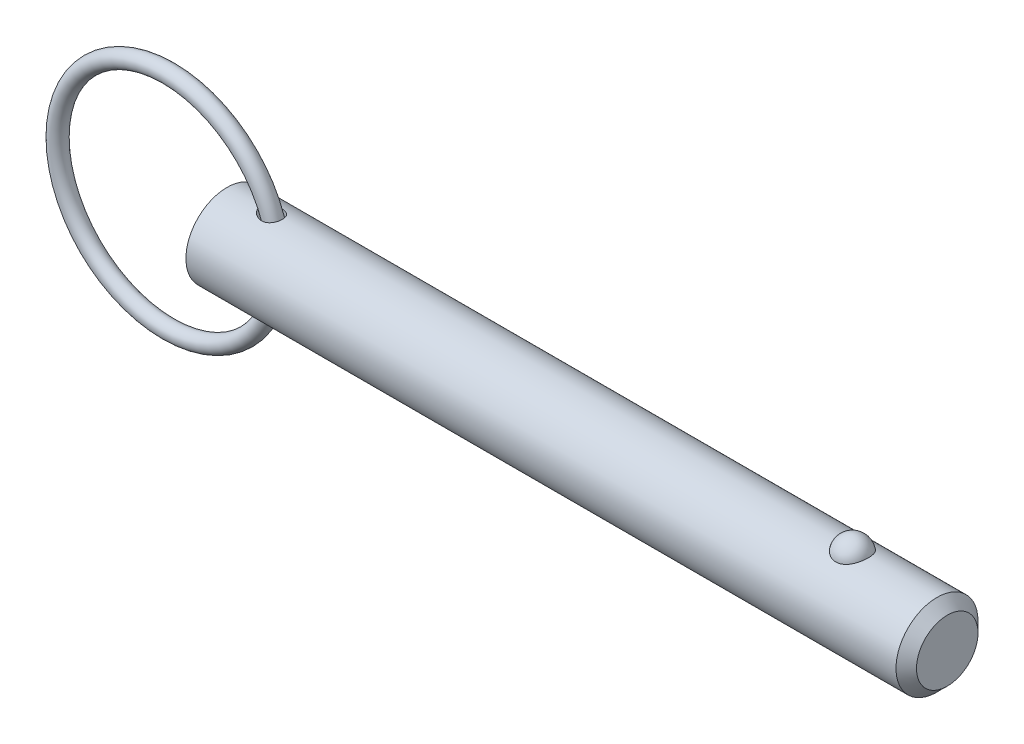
ISO-10303-21;
HEADER;
FILE_DESCRIPTION(('STEP AP214'),'2;1');
FILE_NAME('part.step','',(''),(''),'','','');
FILE_SCHEMA(('AUTOMOTIVE_DESIGN { 1 0 10303 214 1 1 1 1 }'));
ENDSEC;
DATA;
#1=APPLICATION_CONTEXT('core data for automotive mechanical design processes');
#2=APPLICATION_PROTOCOL_DEFINITION('international standard','automotive_design',2000,#1);
#3=PRODUCT_CONTEXT('',#1,'mechanical');
#4=PRODUCT('Part','Part','',(#3));
#5=PRODUCT_RELATED_PRODUCT_CATEGORY('part','',(#4));
#6=PRODUCT_DEFINITION_FORMATION('','',#4);
#7=PRODUCT_DEFINITION_CONTEXT('part definition',#1,'design');
#8=PRODUCT_DEFINITION('design','',#6,#7);
#9=PRODUCT_DEFINITION_SHAPE('','',#8);
#10=(LENGTH_UNIT() NAMED_UNIT(*) SI_UNIT(.MILLI.,.METRE.));
#11=(NAMED_UNIT(*) PLANE_ANGLE_UNIT() SI_UNIT($,.RADIAN.));
#12=(NAMED_UNIT(*) SI_UNIT($,.STERADIAN.) SOLID_ANGLE_UNIT());
#13=UNCERTAINTY_MEASURE_WITH_UNIT(LENGTH_MEASURE(1.E-05),#10,'distance_accuracy_value','');
#14=(GEOMETRIC_REPRESENTATION_CONTEXT(3) GLOBAL_UNCERTAINTY_ASSIGNED_CONTEXT((#13)) GLOBAL_UNIT_ASSIGNED_CONTEXT((#10,
#11,#12)) REPRESENTATION_CONTEXT('',''));
#15=CARTESIAN_POINT('',(0.,0.,0.));
#16=DIRECTION('',(0.,0.,1.));
#17=DIRECTION('',(1.,0.,0.));
#18=AXIS2_PLACEMENT_3D('',#15,#16,#17);
#19=CARTESIAN_POINT('',(-6.70471658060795,0.,0.));
#20=DIRECTION('',(0.,0.,1.));
#21=DIRECTION('',(1.,0.,0.));
#22=AXIS2_PLACEMENT_3D('',#19,#20,#21);
#23=TOROIDAL_SURFACE('',#22,12.7,0.940000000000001);
#24=CARTESIAN_POINT('',(6.93528341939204,0.,0.));
#25=VERTEX_POINT('',#24);
#26=VERTEX_LOOP('',#25);
#27=FACE_BOUND('',#26,.T.);
#28=ADVANCED_FACE('P0_F12',(#27),#23,.T.);
#29=CLOSED_SHELL('',(#28));
#30=MANIFOLD_SOLID_BREP('P0_B1',#29);
#31=CARTESIAN_POINT('',(0.,0.,0.));
#32=DIRECTION('',(1.,0.,0.));
#33=DIRECTION('',(0.,0.,-1.));
#34=AXIS2_PLACEMENT_3D('',#31,#32,#33);
#35=CYLINDRICAL_SURFACE('',#34,4.7);
#36=CARTESIAN_POINT('',(4.16378072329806,4.63584137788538,-0.773934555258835));
#37=CARTESIAN_POINT('',(4.22041228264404,4.62659903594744,-0.829297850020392));
#38=CARTESIAN_POINT('',(4.28206987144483,4.61719767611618,-0.879522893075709));
#39=CARTESIAN_POINT('',(4.41303152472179,4.59925351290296,-0.968997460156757));
#40=CARTESIAN_POINT('',(4.4823442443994,4.59071170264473,-1.00823437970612));
#41=CARTESIAN_POINT('',(4.626507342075,4.5755493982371,-1.07495006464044));
#42=CARTESIAN_POINT('',(4.70135029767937,4.56892638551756,-1.10244426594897));
#43=CARTESIAN_POINT('',(4.85470490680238,4.55848940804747,-1.14483874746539));
#44=CARTESIAN_POINT('',(4.93321503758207,4.55467428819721,-1.15974420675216));
#45=CARTESIAN_POINT('',(5.09197970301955,4.55051176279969,-1.17597559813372));
#46=CARTESIAN_POINT('',(5.17223836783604,4.55017372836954,-1.17726483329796));
#47=CARTESIAN_POINT('',(5.33159446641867,4.55326696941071,-1.16524823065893));
#48=CARTESIAN_POINT('',(5.41069268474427,4.55669556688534,-1.15195276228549));
#49=CARTESIAN_POINT('',(5.55698758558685,4.56647801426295,-1.11249214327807));
#50=CARTESIAN_POINT('',(5.62458628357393,4.57250771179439,-1.08773548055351));
#51=CARTESIAN_POINT('',(5.75397700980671,4.58665356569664,-1.02644632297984));
#52=CARTESIAN_POINT('',(5.81577171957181,4.59476875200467,-0.989919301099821));
#53=CARTESIAN_POINT('',(5.9268148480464,4.61135052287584,-0.909391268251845));
#54=CARTESIAN_POINT('',(5.9766679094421,4.61973919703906,-0.866204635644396));
#55=CARTESIAN_POINT('',(6.06817854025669,4.63643253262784,-0.771868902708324));
#56=CARTESIAN_POINT('',(6.10983710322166,4.64473720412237,-0.720720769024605));
#57=CARTESIAN_POINT('',(6.18318089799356,4.660174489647,-0.612928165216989));
#58=CARTESIAN_POINT('',(6.21503150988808,4.66732544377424,-0.556398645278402));
#59=CARTESIAN_POINT('',(6.26900210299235,4.67985590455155,-0.438689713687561));
#60=CARTESIAN_POINT('',(6.29112194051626,4.68523538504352,-0.377510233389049));
#61=CARTESIAN_POINT('',(6.32523846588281,4.6936733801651,-0.251831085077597));
#62=CARTESIAN_POINT('',(6.33717189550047,4.69671737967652,-0.187313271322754));
#63=CARTESIAN_POINT('',(6.35042407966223,4.70010386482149,-0.0571258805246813));
#64=CARTESIAN_POINT('',(6.3517424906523,4.70044626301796,0.00854373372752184));
#65=CARTESIAN_POINT('',(6.34371729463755,4.69838816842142,0.139481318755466));
#66=CARTESIAN_POINT('',(6.33432596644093,4.69597539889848,0.204746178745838));
#67=CARTESIAN_POINT('',(6.30500866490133,4.68864655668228,0.332720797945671));
#68=CARTESIAN_POINT('',(6.28508259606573,4.68373046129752,0.39543053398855));
#69=CARTESIAN_POINT('',(6.23516511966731,4.67193431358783,0.516455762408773));
#70=CARTESIAN_POINT('',(6.20518126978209,4.66505573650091,0.574774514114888));
#71=CARTESIAN_POINT('',(6.1358631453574,4.65009270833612,0.685387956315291));
#72=CARTESIAN_POINT('',(6.09652950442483,4.64200833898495,0.737683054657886));
#73=CARTESIAN_POINT('',(6.00979078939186,4.62559001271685,0.834455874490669));
#74=CARTESIAN_POINT('',(5.96243625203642,4.61725787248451,0.878979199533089));
#75=CARTESIAN_POINT('',(5.86079843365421,4.60122574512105,0.959378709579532));
#76=CARTESIAN_POINT('',(5.80651591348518,4.59352568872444,0.995255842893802));
#77=CARTESIAN_POINT('',(5.69277386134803,4.57961669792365,1.05741527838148));
#78=CARTESIAN_POINT('',(5.63333134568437,4.57340309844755,1.08372773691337));
#79=CARTESIAN_POINT('',(5.5108424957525,4.56305640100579,1.12650026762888));
#80=CARTESIAN_POINT('',(5.44779577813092,4.55892352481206,1.14295928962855));
#81=CARTESIAN_POINT('',(5.3179566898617,4.55299444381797,1.1663590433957));
#82=CARTESIAN_POINT('',(5.25110869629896,4.55127026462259,1.17300670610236));
#83=CARTESIAN_POINT('',(5.11716812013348,4.55043953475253,1.17622268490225));
#84=CARTESIAN_POINT('',(5.05007546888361,4.55133378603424,1.17278791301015));
#85=CARTESIAN_POINT('',(4.91166083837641,4.55569951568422,1.15571913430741));
#86=CARTESIAN_POINT('',(4.84044690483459,4.55937764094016,1.1412666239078));
#87=CARTESIAN_POINT('',(4.70108819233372,4.56903562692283,1.10196123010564));
#88=CARTESIAN_POINT('',(4.63294574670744,4.57501720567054,1.07710058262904));
#89=CARTESIAN_POINT('',(4.4947730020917,4.58927184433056,1.01474439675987));
#90=CARTESIAN_POINT('',(4.42520748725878,4.59771156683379,0.976252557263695));
#91=CARTESIAN_POINT('',(4.29354165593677,4.61552030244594,0.888246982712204));
#92=CARTESIAN_POINT('',(4.23143936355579,4.62488906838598,0.838736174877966));
#93=CARTESIAN_POINT('',(4.12609666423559,4.64192969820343,0.738015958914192));
#94=CARTESIAN_POINT('',(4.08142630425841,4.64963595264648,0.688308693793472));
#95=CARTESIAN_POINT('',(4.0008117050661,4.66411457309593,0.582144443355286));
#96=CARTESIAN_POINT('',(3.96485623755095,4.6708881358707,0.525696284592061));
#97=CARTESIAN_POINT('',(3.9081839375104,4.68183565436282,0.41591755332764));
#98=CARTESIAN_POINT('',(3.88599581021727,4.68624644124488,0.363372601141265));
#99=CARTESIAN_POINT('',(3.85055971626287,4.693376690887,0.255230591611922));
#100=CARTESIAN_POINT('',(3.83730635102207,4.69609717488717,0.199635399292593));
#101=CARTESIAN_POINT('',(3.82058225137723,4.69954043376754,0.0867104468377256));
#102=CARTESIAN_POINT('',(3.81714632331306,4.70025610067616,0.0293752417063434));
#103=CARTESIAN_POINT('',(3.8204140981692,4.69957935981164,-0.084992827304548));
#104=CARTESIAN_POINT('',(3.82711802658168,4.69818690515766,-0.142025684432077));
#105=CARTESIAN_POINT('',(3.84950128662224,4.69360426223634,-0.250744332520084));
#106=CARTESIAN_POINT('',(3.86463891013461,4.69052274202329,-0.302548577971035));
#107=CARTESIAN_POINT('',(3.9026119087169,4.68295207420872,-0.403121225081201));
#108=CARTESIAN_POINT('',(3.92544863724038,4.67846267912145,-0.451889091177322));
#109=CARTESIAN_POINT('',(3.9799930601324,4.6680441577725,-0.549522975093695));
#110=CARTESIAN_POINT('',(4.01228648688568,4.66202553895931,-0.598050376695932));
#111=CARTESIAN_POINT('',(4.08340845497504,4.64931397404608,-0.689954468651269));
#112=CARTESIAN_POINT('',(4.1222426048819,4.64262045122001,-0.733326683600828));
#113=CARTESIAN_POINT('',(4.16378072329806,4.63584137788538,-0.773934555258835));
#114=B_SPLINE_CURVE_WITH_KNOTS('',3,(#36,#37,#38,#39,#40,#41,#42,#43,#44,#45,#46,#47,#48,#49,
#50,#51,#52,#53,#54,#55,#56,#57,#58,#59,#60,#61,#62,#63,#64,#65,#66,#67,#68,#69,#70,#71,#72,#73,
#74,#75,#76,#77,#78,#79,#80,#81,#82,#83,#84,#85,#86,#87,#88,#89,#90,#91,#92,#93,#94,#95,#96,#97,
#98,#99,#100,#101,#102,#103,#104,#105,#106,#107,#108,#109,#110,#111,#112,#113),.UNSPECIFIED.,
.T.,.F.,(4,2,2,2,2,2,2,2,2,2,2,2,2,2,2,2,2,2,2,2,2,2,2,2,2,2,2,2,2,2,2,2,2,2,2,2,2,2,4),(0.,
0.238977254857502,0.478227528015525,0.717162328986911,0.955998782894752,1.19547875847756,
1.43478857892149,1.65034375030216,1.86579883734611,2.06429861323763,2.2627743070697,
2.45769248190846,2.65261353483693,2.848736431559,3.04486567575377,3.24187227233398,
3.43888065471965,3.63574133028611,3.83258866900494,4.0282389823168,4.22386782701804,
4.41887441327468,4.61390177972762,4.81464443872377,5.0154485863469,5.23282834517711,
5.45037055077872,5.68914354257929,5.9278531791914,6.12887730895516,6.32964104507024,
6.50053592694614,6.67132745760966,6.84272375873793,7.01412387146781,7.17560768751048,
7.33711990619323,7.51225400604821,7.68753905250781),.UNSPECIFIED.);
#115=CARTESIAN_POINT('',(4.16378072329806,4.63584137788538,-0.773934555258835));
#116=VERTEX_POINT('',#115);
#117=EDGE_CURVE('P1_E40',#116,#116,#114,.T.);
#118=ORIENTED_EDGE('',*,*,#117,.T.);
#119=EDGE_LOOP('',(#118));
#120=FACE_BOUND('',#119,.T.);
#121=CARTESIAN_POINT('',(81.375,0.,0.));
#122=DIRECTION('',(1.,0.,0.));
#123=DIRECTION('',(0.,0.,-1.));
#124=AXIS2_PLACEMENT_3D('',#121,#122,#123);
#125=CIRCLE('',#124,4.7);
#126=CARTESIAN_POINT('',(81.375,0.,-4.7));
#127=VERTEX_POINT('',#126);
#128=EDGE_CURVE('P1_E25',#127,#127,#125,.T.);
#129=ORIENTED_EDGE('',*,*,#128,.F.);
#130=EDGE_LOOP('',(#129));
#131=FACE_BOUND('',#130,.T.);
#132=CARTESIAN_POINT('',(0.,0.,0.));
#133=DIRECTION('',(1.,0.,0.));
#134=DIRECTION('',(0.,0.,-1.));
#135=AXIS2_PLACEMENT_3D('',#132,#133,#134);
#136=CIRCLE('',#135,4.7);
#137=CARTESIAN_POINT('',(0.,0.,-4.7));
#138=VERTEX_POINT('',#137);
#139=EDGE_CURVE('P1_E9',#138,#138,#136,.T.);
#140=ORIENTED_EDGE('',*,*,#139,.T.);
#141=EDGE_LOOP('',(#140));
#142=FACE_BOUND('',#141,.T.);
#143=CARTESIAN_POINT('',(71.6806283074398,4.30387706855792,1.88855557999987));
#144=CARTESIAN_POINT('',(71.5828134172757,4.30388592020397,1.88854684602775));
#145=CARTESIAN_POINT('',(71.4848511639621,4.30731231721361,1.88078712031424));
#146=CARTESIAN_POINT('',(71.291662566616,4.32065009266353,1.84993192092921));
#147=CARTESIAN_POINT('',(71.1964438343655,4.33057798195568,1.82679740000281));
#148=CARTESIAN_POINT('',(71.0118175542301,4.3557457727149,1.76594245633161));
#149=CARTESIAN_POINT('',(70.9223953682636,4.37097162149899,1.72826059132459));
#150=CARTESIAN_POINT('',(70.7513907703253,4.4050778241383,1.6393730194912));
#151=CARTESIAN_POINT('',(70.669805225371,4.4239567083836,1.58817274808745));
#152=CARTESIAN_POINT('',(70.5139011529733,4.46404088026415,1.47181116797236));
#153=CARTESIAN_POINT('',(70.4398759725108,4.48529915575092,1.40627540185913));
#154=CARTESIAN_POINT('',(70.3035361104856,4.527485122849,1.26387806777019));
#155=CARTESIAN_POINT('',(70.2412249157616,4.54841271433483,1.18701313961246));
#156=CARTESIAN_POINT('',(70.1270723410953,4.58876216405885,1.02025841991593));
#157=CARTESIAN_POINT('',(70.0758113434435,4.60807744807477,0.929944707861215));
#158=CARTESIAN_POINT('',(69.9884245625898,4.6421320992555,0.741468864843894));
#159=CARTESIAN_POINT('',(69.9522995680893,4.65687122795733,0.643306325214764));
#160=CARTESIAN_POINT('',(69.8956718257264,4.68038485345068,0.440967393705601));
#161=CARTESIAN_POINT('',(69.8753048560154,4.68910744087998,0.336746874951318));
#162=CARTESIAN_POINT('',(69.8511323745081,4.69949255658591,0.126059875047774));
#163=CARTESIAN_POINT('',(69.8473260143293,4.70115544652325,0.0195935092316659));
#164=CARTESIAN_POINT('',(69.8563081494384,4.69727256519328,-0.191500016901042));
#165=CARTESIAN_POINT('',(69.8689415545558,4.69179416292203,-0.296135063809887));
#166=CARTESIAN_POINT('',(69.9102760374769,4.67429351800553,-0.501612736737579));
#167=CARTESIAN_POINT('',(69.9389773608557,4.66227117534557,-0.602455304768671));
#168=CARTESIAN_POINT('',(70.0119285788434,4.63286427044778,-0.79770793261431));
#169=CARTESIAN_POINT('',(70.0562044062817,4.61547077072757,-0.892106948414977));
#170=CARTESIAN_POINT('',(70.1594074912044,4.57709900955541,-1.07173134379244));
#171=CARTESIAN_POINT('',(70.2183362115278,4.55612039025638,-1.15695580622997));
#172=CARTESIAN_POINT('',(70.3502161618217,4.51257918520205,-1.31664252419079));
#173=CARTESIAN_POINT('',(70.4232867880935,4.49000423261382,-1.39100294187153));
#174=CARTESIAN_POINT('',(70.5814784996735,4.44594443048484,-1.52598548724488));
#175=CARTESIAN_POINT('',(70.6665990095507,4.42445952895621,-1.58660827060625));
#176=CARTESIAN_POINT('',(70.8452673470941,4.38543655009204,-1.69145998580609));
#177=CARTESIAN_POINT('',(70.9386518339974,4.36783887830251,-1.73594433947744));
#178=CARTESIAN_POINT('',(71.1324220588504,4.3382941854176,-1.8085227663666));
#179=CARTESIAN_POINT('',(71.2328051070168,4.32634500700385,-1.83662309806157));
#180=CARTESIAN_POINT('',(71.4322875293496,4.31005085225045,-1.87453136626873));
#181=CARTESIAN_POINT('',(71.5311967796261,4.30535309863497,-1.88518956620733));
#182=CARTESIAN_POINT('',(71.7295210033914,4.30299844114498,-1.89055986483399));
#183=CARTESIAN_POINT('',(71.8289358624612,4.30534000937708,-1.88527542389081));
#184=CARTESIAN_POINT('',(72.0218638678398,4.31657737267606,-1.85939299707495));
#185=CARTESIAN_POINT('',(72.1154624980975,4.32524571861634,-1.83932621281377));
#186=CARTESIAN_POINT('',(72.2977839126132,4.34791518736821,-1.7850744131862));
#187=CARTESIAN_POINT('',(72.3865063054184,4.36191673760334,-1.75088826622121));
#188=CARTESIAN_POINT('',(72.558694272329,4.39411605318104,-1.66845234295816));
#189=CARTESIAN_POINT('',(72.6420089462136,4.41239631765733,-1.61992036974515));
#190=CARTESIAN_POINT('',(72.799399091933,4.45109244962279,-1.51034589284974));
#191=CARTESIAN_POINT('',(72.8734723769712,4.47150882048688,-1.44930043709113));
#192=CARTESIAN_POINT('',(73.0144058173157,4.51353865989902,-1.31275193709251));
#193=CARTESIAN_POINT('',(73.0807014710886,4.53515983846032,-1.23666813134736));
#194=CARTESIAN_POINT('',(73.2000698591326,4.57635116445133,-1.07425533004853));
#195=CARTESIAN_POINT('',(73.2531402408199,4.59592094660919,-0.987924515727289));
#196=CARTESIAN_POINT('',(73.3464438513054,4.63161819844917,-0.804428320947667));
#197=CARTESIAN_POINT('',(73.3862298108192,4.64762063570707,-0.707010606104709));
#198=CARTESIAN_POINT('',(73.4498257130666,4.67374032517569,-0.506344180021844));
#199=CARTESIAN_POINT('',(73.4736358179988,4.68385763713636,-0.403095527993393));
#200=CARTESIAN_POINT('',(73.5047510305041,4.69716075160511,-0.193975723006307));
#201=CARTESIAN_POINT('',(73.5120987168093,4.70036443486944,-0.088112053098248));
#202=CARTESIAN_POINT('',(73.5102611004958,4.6995691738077,0.123441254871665));
#203=CARTESIAN_POINT('',(73.5010764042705,4.69557049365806,0.229130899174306));
#204=CARTESIAN_POINT('',(73.4664922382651,4.68082941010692,0.436545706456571));
#205=CARTESIAN_POINT('',(73.441209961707,4.67013575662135,0.53829393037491));
#206=CARTESIAN_POINT('',(73.375050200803,4.64311776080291,0.735797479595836));
#207=CARTESIAN_POINT('',(73.334171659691,4.62679303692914,0.831552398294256));
#208=CARTESIAN_POINT('',(73.2372869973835,4.59002712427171,1.01512750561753));
#209=CARTESIAN_POINT('',(73.1811735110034,4.56955699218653,1.10288523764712));
#210=CARTESIAN_POINT('',(73.0551085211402,4.52671789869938,1.26730106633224));
#211=CARTESIAN_POINT('',(72.9851572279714,4.50434896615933,1.34395933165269));
#212=CARTESIAN_POINT('',(72.8327247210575,4.46008413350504,1.48428028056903));
#213=CARTESIAN_POINT('',(72.7502095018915,4.43818970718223,1.54790656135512));
#214=CARTESIAN_POINT('',(72.5747358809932,4.39746476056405,1.6600850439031));
#215=CARTESIAN_POINT('',(72.4817736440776,4.37863537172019,1.70863168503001));
#216=CARTESIAN_POINT('',(72.2910997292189,4.34688784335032,1.78783023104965));
#217=CARTESIAN_POINT('',(72.1936298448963,4.33380220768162,1.81899757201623));
#218=CARTESIAN_POINT('',(71.9944052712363,4.31435159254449,1.86467392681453));
#219=CARTESIAN_POINT('',(71.8926639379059,4.30796708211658,1.87923136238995));
#220=CARTESIAN_POINT('',(71.7539136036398,4.3043503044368,1.8874737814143));
#221=CARTESIAN_POINT('',(71.71728130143,4.30387375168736,1.8885588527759));
#222=CARTESIAN_POINT('',(71.6806283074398,4.30387706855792,1.88855557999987));
#223=B_SPLINE_CURVE_WITH_KNOTS('',3,(#143,#144,#145,#146,#147,#148,#149,#150,#151,#152,#153,
#154,#155,#156,#157,#158,#159,#160,#161,#162,#163,#164,#165,#166,#167,#168,#169,#170,#171,#172,
#173,#174,#175,#176,#177,#178,#179,#180,#181,#182,#183,#184,#185,#186,#187,#188,#189,#190,#191,
#192,#193,#194,#195,#196,#197,#198,#199,#200,#201,#202,#203,#204,#205,#206,#207,#208,#209,#210,
#211,#212,#213,#214,#215,#216,#217,#218,#219,#220,#221,#222),.UNSPECIFIED.,.T.,.F.,(4,2,2,2,2,2,
2,2,2,2,2,2,2,2,2,2,2,2,2,2,2,2,2,2,2,2,2,2,2,2,2,2,2,2,2,2,2,2,2,4),(0.,0.293339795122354,
0.587427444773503,0.880740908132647,1.17393661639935,1.4759741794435,1.77810150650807,
2.09350493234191,2.40892479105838,2.72703308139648,3.04512507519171,3.36023788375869,
3.67535550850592,3.99100033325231,4.30667668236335,4.62514463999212,4.94359739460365,
5.25676407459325,5.56981105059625,5.86708641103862,6.1642972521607,6.4513188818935,
6.73836351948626,7.03148013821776,7.3246659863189,7.63288296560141,7.94115473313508,
8.25895074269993,8.57674352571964,8.89371340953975,9.21067166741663,9.52534839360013,
9.84004644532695,10.157022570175,10.4739938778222,10.7918388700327,11.1098009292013,
11.41774884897,11.7247967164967,11.834716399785),.UNSPECIFIED.);
#224=CARTESIAN_POINT('',(71.6806283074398,4.30387706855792,1.88855557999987));
#225=VERTEX_POINT('',#224);
#226=EDGE_CURVE('P1_E34',#225,#225,#223,.T.);
#227=ORIENTED_EDGE('',*,*,#226,.T.);
#228=EDGE_LOOP('',(#227));
#229=FACE_BOUND('',#228,.T.);
#230=CARTESIAN_POINT('',(4.16378072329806,-4.63584137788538,-0.773934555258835));
#231=CARTESIAN_POINT('',(4.11797605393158,-4.64331682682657,-0.729154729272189));
#232=CARTESIAN_POINT('',(4.07545237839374,-4.65068929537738,-0.681007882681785));
#233=CARTESIAN_POINT('',(3.99850919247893,-4.66454993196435,-0.578483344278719));
#234=CARTESIAN_POINT('',(3.9640846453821,-4.67103864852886,-0.524109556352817));
#235=CARTESIAN_POINT('',(3.90486465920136,-4.68247538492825,-0.409579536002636));
#236=CARTESIAN_POINT('',(3.88014787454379,-4.68741075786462,-0.349380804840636));
#237=CARTESIAN_POINT('',(3.84254060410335,-4.69500854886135,-0.225256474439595));
#238=CARTESIAN_POINT('',(3.8296375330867,-4.69767338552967,-0.161334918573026));
#239=CARTESIAN_POINT('',(3.81750619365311,-4.70018000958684,-0.0396774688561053));
#240=CARTESIAN_POINT('',(3.8168623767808,-4.70031401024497,0.017913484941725));
#241=CARTESIAN_POINT('',(3.82570055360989,-4.69848615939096,0.132270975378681));
#242=CARTESIAN_POINT('',(3.83518142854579,-4.6965245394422,0.189037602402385));
#243=CARTESIAN_POINT('',(3.8627670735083,-4.69091189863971,0.296808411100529));
#244=CARTESIAN_POINT('',(3.88034293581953,-4.68736483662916,0.347956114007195));
#245=CARTESIAN_POINT('',(3.92293217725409,-4.67896699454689,0.446919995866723));
#246=CARTESIAN_POINT('',(3.94794743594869,-4.67411588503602,0.494735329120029));
#247=CARTESIAN_POINT('',(4.00723361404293,-4.66297432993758,0.590975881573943));
#248=CARTESIAN_POINT('',(4.04218787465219,-4.65658759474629,0.638966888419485));
#249=CARTESIAN_POINT('',(4.11850165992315,-4.6432741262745,0.729452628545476));
#250=CARTESIAN_POINT('',(4.15986486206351,-4.63634708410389,0.771944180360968));
#251=CARTESIAN_POINT('',(4.25563139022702,-4.62124878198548,0.858077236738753));
#252=CARTESIAN_POINT('',(4.3110472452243,-4.61307408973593,0.900593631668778));
#253=CARTESIAN_POINT('',(4.42760239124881,-4.59748077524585,0.977085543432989));
#254=CARTESIAN_POINT('',(4.48874590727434,-4.59006271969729,1.01105468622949));
#255=CARTESIAN_POINT('',(4.62409915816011,-4.57577604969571,1.07399161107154));
#256=CARTESIAN_POINT('',(4.69895162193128,-4.56912175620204,1.10163764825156));
#257=CARTESIAN_POINT('',(4.85238616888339,-4.55861611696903,1.14433682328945));
#258=CARTESIAN_POINT('',(4.93096882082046,-4.55476520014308,1.15938803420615));
#259=CARTESIAN_POINT('',(5.08983848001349,-4.55053674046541,1.17587995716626));
#260=CARTESIAN_POINT('',(5.17012835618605,-4.55016559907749,1.17729558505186));
#261=CARTESIAN_POINT('',(5.32956049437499,-4.55319561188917,1.16552635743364));
#262=CARTESIAN_POINT('',(5.40870366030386,-4.55659361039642,1.15235371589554));
#263=CARTESIAN_POINT('',(5.55512154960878,-4.56632591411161,1.11311448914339));
#264=CARTESIAN_POINT('',(5.62279525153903,-4.57233592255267,1.08845479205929));
#265=CARTESIAN_POINT('',(5.75235194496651,-4.58645252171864,1.02734156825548));
#266=CARTESIAN_POINT('',(5.81423750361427,-4.59455817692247,0.990893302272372));
#267=CARTESIAN_POINT('',(5.92544729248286,-4.61112960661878,0.910507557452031));
#268=CARTESIAN_POINT('',(5.9753775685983,-4.61951638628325,0.867388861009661));
#269=CARTESIAN_POINT('',(6.06705041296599,-4.63621447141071,0.773173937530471));
#270=CARTESIAN_POINT('',(6.10879399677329,-4.64452578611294,0.722078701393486));
#271=CARTESIAN_POINT('',(6.18230323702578,-4.65998194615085,0.614385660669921));
#272=CARTESIAN_POINT('',(6.21423602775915,-4.66714520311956,0.557904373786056));
#273=CARTESIAN_POINT('',(6.26837651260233,-4.67970630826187,0.440277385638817));
#274=CARTESIAN_POINT('',(6.29058407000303,-4.68510413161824,0.379131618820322));
#275=CARTESIAN_POINT('',(6.32487950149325,-4.69358284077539,0.253506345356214));
#276=CARTESIAN_POINT('',(6.33690441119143,-4.69664929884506,0.189008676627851));
#277=CARTESIAN_POINT('',(6.3503414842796,-4.70008248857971,0.0588455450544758));
#278=CARTESIAN_POINT('',(6.35175330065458,-4.70044913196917,-0.00681995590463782));
#279=CARTESIAN_POINT('',(6.34391515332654,-4.69843881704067,-0.137767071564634));
#280=CARTESIAN_POINT('',(6.33461722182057,-4.69604951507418,-0.203045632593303));
#281=CARTESIAN_POINT('',(6.30548404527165,-4.68876413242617,-0.331063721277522));
#282=CARTESIAN_POINT('',(6.2856487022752,-4.68386802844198,-0.393803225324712));
#283=CARTESIAN_POINT('',(6.23590713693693,-4.67210599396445,-0.514904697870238));
#284=CARTESIAN_POINT('',(6.20600824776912,-4.66524149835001,-0.573269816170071));
#285=CARTESIAN_POINT('',(6.13685224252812,-4.65029918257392,-0.683989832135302));
#286=CARTESIAN_POINT('',(6.09759575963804,-4.6422214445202,-0.736345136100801));
#287=CARTESIAN_POINT('',(6.01099960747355,-4.62580793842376,-0.833250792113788));
#288=CARTESIAN_POINT('',(5.96371037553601,-4.61747403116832,-0.87784652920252));
#289=CARTESIAN_POINT('',(5.86219002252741,-4.60143050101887,-0.958399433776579));
#290=CARTESIAN_POINT('',(5.80795966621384,-4.59372080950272,-0.994357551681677));
#291=CARTESIAN_POINT('',(5.69431062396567,-4.57978661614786,-1.05668157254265));
#292=CARTESIAN_POINT('',(5.63490936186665,-4.57355737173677,-1.08307825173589));
#293=CARTESIAN_POINT('',(5.51248756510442,-4.56317492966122,-1.12602176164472));
#294=CARTESIAN_POINT('',(5.44946662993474,-4.55902196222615,-1.1425675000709));
#295=CARTESIAN_POINT('',(5.3196775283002,-4.55305083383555,-1.16613984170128));
#296=CARTESIAN_POINT('',(5.25285368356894,-4.55130415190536,-1.17287534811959));
#297=CARTESIAN_POINT('',(5.11894995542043,-4.55042807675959,-1.17626714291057));
#298=CARTESIAN_POINT('',(5.05187000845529,-4.55129938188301,-1.17292074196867));
#299=CARTESIAN_POINT('',(4.91348721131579,-4.55561850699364,-1.15603764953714));
#300=CARTESIAN_POINT('',(4.84229084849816,-4.55927235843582,-1.14168541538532));
#301=CARTESIAN_POINT('',(4.70293860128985,-4.56888540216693,-1.10258192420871));
#302=CARTESIAN_POINT('',(4.63478566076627,-4.57484677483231,-1.07782082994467));
#303=CARTESIAN_POINT('',(4.49401200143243,-4.58932889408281,-1.01452290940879));
#304=CARTESIAN_POINT('',(4.42204931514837,-4.59808779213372,-0.974568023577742));
#305=CARTESIAN_POINT('',(4.28620227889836,-4.61656806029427,-0.88288117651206));
#306=CARTESIAN_POINT('',(4.22231268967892,-4.62628879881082,-0.831156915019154));
#307=CARTESIAN_POINT('',(4.16378072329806,-4.63584137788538,-0.773934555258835));
#308=B_SPLINE_CURVE_WITH_KNOTS('',3,(#230,#231,#232,#233,#234,#235,#236,#237,#238,#239,#240,
#241,#242,#243,#244,#245,#246,#247,#248,#249,#250,#251,#252,#253,#254,#255,#256,#257,#258,#259,
#260,#261,#262,#263,#264,#265,#266,#267,#268,#269,#270,#271,#272,#273,#274,#275,#276,#277,#278,
#279,#280,#281,#282,#283,#284,#285,#286,#287,#288,#289,#290,#291,#292,#293,#294,#295,#296,#297,
#298,#299,#300,#301,#302,#303,#304,#305,#306,#307),.UNSPECIFIED.,.T.,.F.,(4,2,2,2,2,2,2,2,2,2,2,
2,2,2,2,2,2,2,2,2,2,2,2,2,2,2,2,2,2,2,2,2,2,2,2,2,2,2,4),(0.,0.19326332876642,0.386406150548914,
0.581083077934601,0.775552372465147,0.947410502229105,1.11924964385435,1.28117818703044,
1.44314767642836,1.62161944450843,1.80019400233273,2.01034324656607,2.22064874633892,
2.45975127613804,2.69889038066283,2.93846932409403,3.1778478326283,3.39350806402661,
3.60907218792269,3.80761226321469,4.00612769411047,4.20104508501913,4.39596521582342,
4.59208201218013,4.78820522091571,4.98521027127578,5.18221715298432,5.37908078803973,
5.5759311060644,5.77158824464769,5.96722384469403,6.1622240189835,6.35724581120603,
6.55794420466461,6.75869613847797,6.97596054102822,7.19343073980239,7.44055547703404,
7.68751900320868),.UNSPECIFIED.);
#309=CARTESIAN_POINT('',(4.16378072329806,-4.63584137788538,-0.773934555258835));
#310=VERTEX_POINT('',#309);
#311=EDGE_CURVE('P1_E17',#310,#310,#308,.T.);
#312=ORIENTED_EDGE('',*,*,#311,.T.);
#313=EDGE_LOOP('',(#312));
#314=FACE_BOUND('',#313,.T.);
#315=ADVANCED_FACE('P1_F13',(#120,#131,#142,#229,#314),#35,.T.);
#316=CARTESIAN_POINT('',(0.,0.,0.));
#317=DIRECTION('',(-1.,0.,0.));
#318=DIRECTION('',(0.,0.,1.));
#319=AXIS2_PLACEMENT_3D('',#316,#317,#318);
#320=PLANE('',#319);
#321=ORIENTED_EDGE('',*,*,#139,.F.);
#322=EDGE_LOOP('',(#321));
#323=FACE_BOUND('',#322,.T.);
#324=ADVANCED_FACE('P1_F15',(#323),#320,.T.);
#325=CARTESIAN_POINT('',(82.55,0.,0.));
#326=DIRECTION('',(-1.,0.,0.));
#327=DIRECTION('',(0.,0.,1.));
#328=AXIS2_PLACEMENT_3D('',#325,#326,#327);
#329=CONICAL_SURFACE('',#328,3.52500000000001,0.785398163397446);
#330=ORIENTED_EDGE('',*,*,#128,.T.);
#331=EDGE_LOOP('',(#330));
#332=FACE_BOUND('',#331,.T.);
#333=CARTESIAN_POINT('',(82.55,0.,0.));
#334=DIRECTION('',(1.,0.,0.));
#335=DIRECTION('',(0.,0.,-1.));
#336=AXIS2_PLACEMENT_3D('',#333,#334,#335);
#337=CIRCLE('',#336,3.52500000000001);
#338=CARTESIAN_POINT('',(82.55,0.,-3.52500000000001));
#339=VERTEX_POINT('',#338);
#340=EDGE_CURVE('P1_E30',#339,#339,#337,.T.);
#341=ORIENTED_EDGE('',*,*,#340,.F.);
#342=EDGE_LOOP('',(#341));
#343=FACE_BOUND('',#342,.T.);
#344=ADVANCED_FACE('P1_F55',(#332,#343),#329,.T.);
#345=CARTESIAN_POINT('',(82.55,3.52500000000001,0.));
#346=DIRECTION('',(1.,0.,0.));
#347=DIRECTION('',(0.,0.,-1.));
#348=AXIS2_PLACEMENT_3D('',#345,#346,#347);
#349=PLANE('',#348);
#350=ORIENTED_EDGE('',*,*,#340,.T.);
#351=EDGE_LOOP('',(#350));
#352=FACE_BOUND('',#351,.T.);
#353=ADVANCED_FACE('P1_F51',(#352),#349,.T.);
#354=CARTESIAN_POINT('',(71.6806283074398,4.23,0.));
#355=DIRECTION('',(-1.,0.,0.));
#356=DIRECTION('',(0.,1.,0.));
#357=AXIS2_PLACEMENT_3D('',#354,#355,#356);
#358=SPHERICAL_SURFACE('',#357,1.89);
#359=ORIENTED_EDGE('',*,*,#226,.F.);
#360=EDGE_LOOP('',(#359));
#361=FACE_BOUND('',#360,.T.);
#362=ADVANCED_FACE('P1_F46',(#361),#358,.T.);
#363=CARTESIAN_POINT('',(-6.70471658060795,0.,0.));
#364=DIRECTION('',(0.,0.,1.));
#365=DIRECTION('',(1.,0.,0.));
#366=AXIS2_PLACEMENT_3D('',#363,#364,#365);
#367=TOROIDAL_SURFACE('',#366,12.7,1.175);
#368=ORIENTED_EDGE('',*,*,#311,.F.);
#369=EDGE_LOOP('',(#368));
#370=FACE_BOUND('',#369,.T.);
#371=ORIENTED_EDGE('',*,*,#117,.F.);
#372=EDGE_LOOP('',(#371));
#373=FACE_BOUND('',#372,.T.);
#374=ADVANCED_FACE('P1_F50',(#370,#373),#367,.F.);
#375=CLOSED_SHELL('',(#315,#324,#344,#353,#362,#374));
#376=MANIFOLD_SOLID_BREP('P1_B1',#375);
#377=ADVANCED_BREP_SHAPE_REPRESENTATION('',(#18,#30,#376),#14);
#378=SHAPE_DEFINITION_REPRESENTATION(#9,#377);
ENDSEC;
END-ISO-10303-21;
